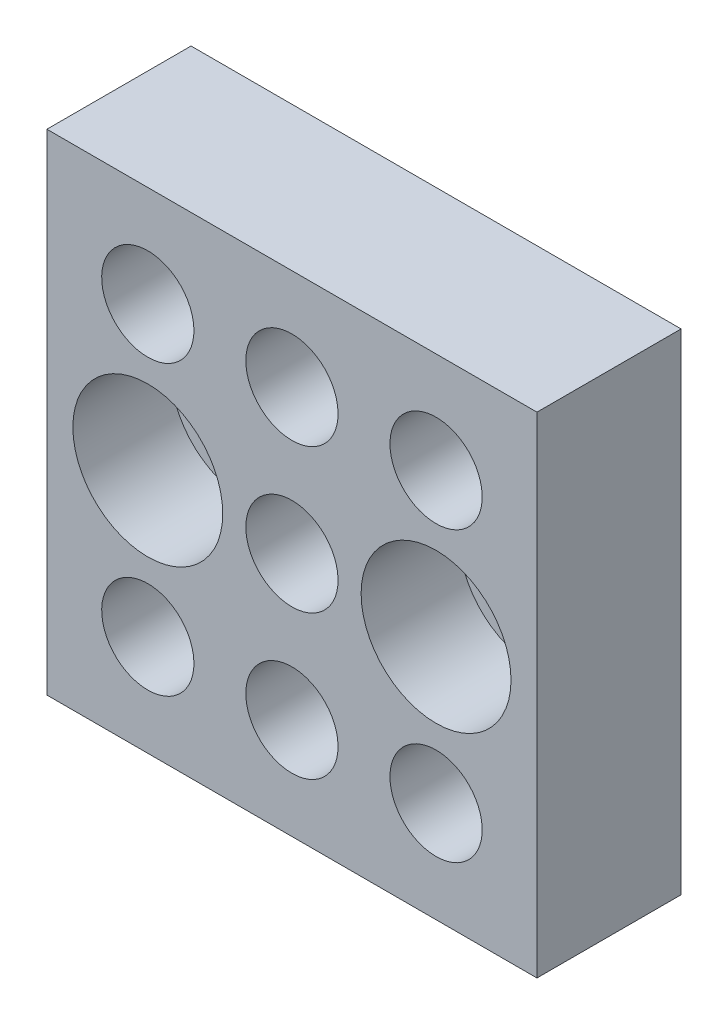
ISO-10303-21;
HEADER;
FILE_DESCRIPTION(('STEP AP214'),'2;1');
FILE_NAME('part.step','',(''),(''),'','','');
FILE_SCHEMA(('AUTOMOTIVE_DESIGN { 1 0 10303 214 1 1 1 1 }'));
ENDSEC;
DATA;
#1=APPLICATION_CONTEXT('core data for automotive mechanical design processes');
#2=APPLICATION_PROTOCOL_DEFINITION('international standard','automotive_design',2000,#1);
#3=PRODUCT_CONTEXT('',#1,'mechanical');
#4=PRODUCT('Part','Part','',(#3));
#5=PRODUCT_RELATED_PRODUCT_CATEGORY('part','',(#4));
#6=PRODUCT_DEFINITION_FORMATION('','',#4);
#7=PRODUCT_DEFINITION_CONTEXT('part definition',#1,'design');
#8=PRODUCT_DEFINITION('design','',#6,#7);
#9=PRODUCT_DEFINITION_SHAPE('','',#8);
#10=(LENGTH_UNIT() NAMED_UNIT(*) SI_UNIT(.MILLI.,.METRE.));
#11=(NAMED_UNIT(*) PLANE_ANGLE_UNIT() SI_UNIT($,.RADIAN.));
#12=(NAMED_UNIT(*) SI_UNIT($,.STERADIAN.) SOLID_ANGLE_UNIT());
#13=UNCERTAINTY_MEASURE_WITH_UNIT(LENGTH_MEASURE(1.E-05),#10,'distance_accuracy_value','');
#14=(GEOMETRIC_REPRESENTATION_CONTEXT(3) GLOBAL_UNCERTAINTY_ASSIGNED_CONTEXT((#13)) GLOBAL_UNIT_ASSIGNED_CONTEXT((#10,
#11,#12)) REPRESENTATION_CONTEXT('',''));
#15=CARTESIAN_POINT('',(0.,0.,0.));
#16=DIRECTION('',(0.,0.,1.));
#17=DIRECTION('',(1.,0.,0.));
#18=AXIS2_PLACEMENT_3D('',#15,#16,#17);
#19=CARTESIAN_POINT('',(-17.5,-42.5,25.));
#20=DIRECTION('',(0.,0.,-1.));
#21=DIRECTION('',(0.,1.,0.));
#22=AXIS2_PLACEMENT_3D('',#19,#20,#21);
#23=PLANE('',#22);
#24=CARTESIAN_POINT('',(50.,0.,25.));
#25=DIRECTION('',(0.,0.,1.));
#26=DIRECTION('',(0.,-1.,0.));
#27=AXIS2_PLACEMENT_3D('',#24,#25,#26);
#28=CIRCLE('',#27,13.);
#29=CARTESIAN_POINT('',(50.,-13.,25.));
#30=VERTEX_POINT('',#29);
#31=EDGE_CURVE('E132',#30,#30,#28,.T.);
#32=ORIENTED_EDGE('',*,*,#31,.F.);
#33=EDGE_LOOP('',(#32));
#34=FACE_BOUND('',#33,.T.);
#35=CARTESIAN_POINT('',(50.,25.,25.));
#36=DIRECTION('',(0.,0.,1.));
#37=DIRECTION('',(0.,-1.,0.));
#38=AXIS2_PLACEMENT_3D('',#35,#36,#37);
#39=CIRCLE('',#38,8.);
#40=CARTESIAN_POINT('',(50.,17.,25.));
#41=VERTEX_POINT('',#40);
#42=EDGE_CURVE('E120',#41,#41,#39,.T.);
#43=ORIENTED_EDGE('',*,*,#42,.F.);
#44=EDGE_LOOP('',(#43));
#45=FACE_BOUND('',#44,.T.);
#46=CARTESIAN_POINT('',(25.,25.,25.));
#47=DIRECTION('',(0.,0.,1.));
#48=DIRECTION('',(0.,-1.,0.));
#49=AXIS2_PLACEMENT_3D('',#46,#47,#48);
#50=CIRCLE('',#49,8.);
#51=CARTESIAN_POINT('',(25.,17.,25.));
#52=VERTEX_POINT('',#51);
#53=EDGE_CURVE('E108',#52,#52,#50,.T.);
#54=ORIENTED_EDGE('',*,*,#53,.F.);
#55=EDGE_LOOP('',(#54));
#56=FACE_BOUND('',#55,.T.);
#57=CARTESIAN_POINT('',(0.,-25.,25.));
#58=DIRECTION('',(0.,0.,1.));
#59=DIRECTION('',(0.,-1.,0.));
#60=AXIS2_PLACEMENT_3D('',#57,#58,#59);
#61=CIRCLE('',#60,8.);
#62=CARTESIAN_POINT('',(0.,-33.,25.));
#63=VERTEX_POINT('',#62);
#64=EDGE_CURVE('E96',#63,#63,#61,.T.);
#65=ORIENTED_EDGE('',*,*,#64,.F.);
#66=EDGE_LOOP('',(#65));
#67=FACE_BOUND('',#66,.T.);
#68=DIRECTION('',(-1.,0.,0.));
#69=VECTOR('',#68,1.);
#70=CARTESIAN_POINT('',(67.5,-42.5,25.));
#71=LINE('',#70,#69);
#72=CARTESIAN_POINT('',(67.5,-42.5,25.));
#73=VERTEX_POINT('',#72);
#74=CARTESIAN_POINT('',(-17.5,-42.5,25.));
#75=VERTEX_POINT('',#74);
#76=EDGE_CURVE('E56',#73,#75,#71,.T.);
#77=ORIENTED_EDGE('',*,*,#76,.F.);
#78=DIRECTION('',(0.,-1.,0.));
#79=VECTOR('',#78,1.);
#80=CARTESIAN_POINT('',(67.5,42.5,25.));
#81=LINE('',#80,#79);
#82=CARTESIAN_POINT('',(67.5,42.5,25.));
#83=VERTEX_POINT('',#82);
#84=EDGE_CURVE('E62',#83,#73,#81,.T.);
#85=ORIENTED_EDGE('',*,*,#84,.F.);
#86=DIRECTION('',(1.,0.,0.));
#87=VECTOR('',#86,1.);
#88=CARTESIAN_POINT('',(-17.5,42.5,25.));
#89=LINE('',#88,#87);
#90=CARTESIAN_POINT('',(-17.5,42.5,25.));
#91=VERTEX_POINT('',#90);
#92=EDGE_CURVE('E81',#91,#83,#89,.T.);
#93=ORIENTED_EDGE('',*,*,#92,.F.);
#94=DIRECTION('',(0.,1.,0.));
#95=VECTOR('',#94,1.);
#96=CARTESIAN_POINT('',(-17.5,-42.5,25.));
#97=LINE('',#96,#95);
#98=EDGE_CURVE('E83',#75,#91,#97,.T.);
#99=ORIENTED_EDGE('',*,*,#98,.F.);
#100=EDGE_LOOP('',(#77,#85,#93,#99));
#101=FACE_BOUND('',#100,.T.);
#102=CARTESIAN_POINT('',(25.,-25.,25.));
#103=DIRECTION('',(0.,0.,1.));
#104=DIRECTION('',(0.,-1.,0.));
#105=AXIS2_PLACEMENT_3D('',#102,#103,#104);
#106=CIRCLE('',#105,8.);
#107=CARTESIAN_POINT('',(25.,-33.,25.));
#108=VERTEX_POINT('',#107);
#109=EDGE_CURVE('E72',#108,#108,#106,.T.);
#110=ORIENTED_EDGE('',*,*,#109,.F.);
#111=EDGE_LOOP('',(#110));
#112=FACE_BOUND('',#111,.T.);
#113=CARTESIAN_POINT('',(0.,25.,25.));
#114=DIRECTION('',(0.,0.,1.));
#115=DIRECTION('',(0.,-1.,0.));
#116=AXIS2_PLACEMENT_3D('',#113,#114,#115);
#117=CIRCLE('',#116,8.);
#118=CARTESIAN_POINT('',(0.,17.,25.));
#119=VERTEX_POINT('',#118);
#120=EDGE_CURVE('E102',#119,#119,#117,.T.);
#121=ORIENTED_EDGE('',*,*,#120,.F.);
#122=EDGE_LOOP('',(#121));
#123=FACE_BOUND('',#122,.T.);
#124=CARTESIAN_POINT('',(25.,0.,25.));
#125=DIRECTION('',(0.,0.,1.));
#126=DIRECTION('',(0.,-1.,0.));
#127=AXIS2_PLACEMENT_3D('',#124,#125,#126);
#128=CIRCLE('',#127,8.);
#129=CARTESIAN_POINT('',(25.,-8.,25.));
#130=VERTEX_POINT('',#129);
#131=EDGE_CURVE('E114',#130,#130,#128,.T.);
#132=ORIENTED_EDGE('',*,*,#131,.F.);
#133=EDGE_LOOP('',(#132));
#134=FACE_BOUND('',#133,.T.);
#135=CARTESIAN_POINT('',(50.,-25.,25.));
#136=DIRECTION('',(0.,0.,1.));
#137=DIRECTION('',(0.,-1.,0.));
#138=AXIS2_PLACEMENT_3D('',#135,#136,#137);
#139=CIRCLE('',#138,8.);
#140=CARTESIAN_POINT('',(50.,-33.,25.));
#141=VERTEX_POINT('',#140);
#142=EDGE_CURVE('E126',#141,#141,#139,.T.);
#143=ORIENTED_EDGE('',*,*,#142,.F.);
#144=EDGE_LOOP('',(#143));
#145=FACE_BOUND('',#144,.T.);
#146=CARTESIAN_POINT('',(0.,0.,25.));
#147=DIRECTION('',(0.,0.,1.));
#148=DIRECTION('',(0.,-1.,0.));
#149=AXIS2_PLACEMENT_3D('',#146,#147,#148);
#150=CIRCLE('',#149,13.);
#151=CARTESIAN_POINT('',(0.,-13.,25.));
#152=VERTEX_POINT('',#151);
#153=EDGE_CURVE('E144',#152,#152,#150,.T.);
#154=ORIENTED_EDGE('',*,*,#153,.F.);
#155=EDGE_LOOP('',(#154));
#156=FACE_BOUND('',#155,.T.);
#157=ADVANCED_FACE('F14',(#34,#45,#56,#67,#101,#112,#123,#134,#145,#156),#23,.F.);
#158=CARTESIAN_POINT('',(-17.5,-42.5,0.));
#159=DIRECTION('',(0.,0.,-1.));
#160=DIRECTION('',(0.,1.,0.));
#161=AXIS2_PLACEMENT_3D('',#158,#159,#160);
#162=PLANE('',#161);
#163=CARTESIAN_POINT('',(50.,0.,0.));
#164=DIRECTION('',(0.,0.,1.));
#165=DIRECTION('',(0.,-1.,0.));
#166=AXIS2_PLACEMENT_3D('',#163,#164,#165);
#167=CIRCLE('',#166,9.);
#168=CARTESIAN_POINT('',(50.,-9.,0.));
#169=VERTEX_POINT('',#168);
#170=EDGE_CURVE('E141',#169,#169,#167,.T.);
#171=ORIENTED_EDGE('',*,*,#170,.T.);
#172=EDGE_LOOP('',(#171));
#173=FACE_BOUND('',#172,.T.);
#174=CARTESIAN_POINT('',(50.,25.,0.));
#175=DIRECTION('',(0.,0.,1.));
#176=DIRECTION('',(0.,-1.,0.));
#177=AXIS2_PLACEMENT_3D('',#174,#175,#176);
#178=CIRCLE('',#177,8.);
#179=CARTESIAN_POINT('',(50.,17.,0.));
#180=VERTEX_POINT('',#179);
#181=EDGE_CURVE('E123',#180,#180,#178,.T.);
#182=ORIENTED_EDGE('',*,*,#181,.T.);
#183=EDGE_LOOP('',(#182));
#184=FACE_BOUND('',#183,.T.);
#185=CARTESIAN_POINT('',(25.,25.,0.));
#186=DIRECTION('',(0.,0.,1.));
#187=DIRECTION('',(0.,-1.,0.));
#188=AXIS2_PLACEMENT_3D('',#185,#186,#187);
#189=CIRCLE('',#188,8.);
#190=CARTESIAN_POINT('',(25.,17.,0.));
#191=VERTEX_POINT('',#190);
#192=EDGE_CURVE('E111',#191,#191,#189,.T.);
#193=ORIENTED_EDGE('',*,*,#192,.T.);
#194=EDGE_LOOP('',(#193));
#195=FACE_BOUND('',#194,.T.);
#196=CARTESIAN_POINT('',(0.,-25.,0.));
#197=DIRECTION('',(0.,0.,1.));
#198=DIRECTION('',(0.,-1.,0.));
#199=AXIS2_PLACEMENT_3D('',#196,#197,#198);
#200=CIRCLE('',#199,8.);
#201=CARTESIAN_POINT('',(0.,-33.,0.));
#202=VERTEX_POINT('',#201);
#203=EDGE_CURVE('E99',#202,#202,#200,.T.);
#204=ORIENTED_EDGE('',*,*,#203,.T.);
#205=EDGE_LOOP('',(#204));
#206=FACE_BOUND('',#205,.T.);
#207=DIRECTION('',(-1.,0.,0.));
#208=VECTOR('',#207,1.);
#209=CARTESIAN_POINT('',(67.5,-42.5,0.));
#210=LINE('',#209,#208);
#211=CARTESIAN_POINT('',(67.5,-42.5,0.));
#212=VERTEX_POINT('',#211);
#213=CARTESIAN_POINT('',(-17.5,-42.5,0.));
#214=VERTEX_POINT('',#213);
#215=EDGE_CURVE('E54',#212,#214,#210,.T.);
#216=ORIENTED_EDGE('',*,*,#215,.T.);
#217=DIRECTION('',(0.,1.,0.));
#218=VECTOR('',#217,1.);
#219=CARTESIAN_POINT('',(-17.5,-42.5,0.));
#220=LINE('',#219,#218);
#221=CARTESIAN_POINT('',(-17.5,42.5,0.));
#222=VERTEX_POINT('',#221);
#223=EDGE_CURVE('E69',#214,#222,#220,.T.);
#224=ORIENTED_EDGE('',*,*,#223,.T.);
#225=DIRECTION('',(1.,0.,0.));
#226=VECTOR('',#225,1.);
#227=CARTESIAN_POINT('',(-17.5,42.5,0.));
#228=LINE('',#227,#226);
#229=CARTESIAN_POINT('',(67.5,42.5,0.));
#230=VERTEX_POINT('',#229);
#231=EDGE_CURVE('E75',#222,#230,#228,.T.);
#232=ORIENTED_EDGE('',*,*,#231,.T.);
#233=DIRECTION('',(0.,-1.,0.));
#234=VECTOR('',#233,1.);
#235=CARTESIAN_POINT('',(67.5,42.5,0.));
#236=LINE('',#235,#234);
#237=EDGE_CURVE('E71',#230,#212,#236,.T.);
#238=ORIENTED_EDGE('',*,*,#237,.T.);
#239=EDGE_LOOP('',(#216,#224,#232,#238));
#240=FACE_BOUND('',#239,.T.);
#241=CARTESIAN_POINT('',(25.,-25.,0.));
#242=DIRECTION('',(0.,0.,1.));
#243=DIRECTION('',(0.,-1.,0.));
#244=AXIS2_PLACEMENT_3D('',#241,#242,#243);
#245=CIRCLE('',#244,8.);
#246=CARTESIAN_POINT('',(25.,-33.,0.));
#247=VERTEX_POINT('',#246);
#248=EDGE_CURVE('E93',#247,#247,#245,.T.);
#249=ORIENTED_EDGE('',*,*,#248,.T.);
#250=EDGE_LOOP('',(#249));
#251=FACE_BOUND('',#250,.T.);
#252=CARTESIAN_POINT('',(0.,25.,0.));
#253=DIRECTION('',(0.,0.,1.));
#254=DIRECTION('',(0.,-1.,0.));
#255=AXIS2_PLACEMENT_3D('',#252,#253,#254);
#256=CIRCLE('',#255,8.);
#257=CARTESIAN_POINT('',(0.,17.,0.));
#258=VERTEX_POINT('',#257);
#259=EDGE_CURVE('E105',#258,#258,#256,.T.);
#260=ORIENTED_EDGE('',*,*,#259,.T.);
#261=EDGE_LOOP('',(#260));
#262=FACE_BOUND('',#261,.T.);
#263=CARTESIAN_POINT('',(25.,0.,0.));
#264=DIRECTION('',(0.,0.,1.));
#265=DIRECTION('',(0.,-1.,0.));
#266=AXIS2_PLACEMENT_3D('',#263,#264,#265);
#267=CIRCLE('',#266,8.);
#268=CARTESIAN_POINT('',(25.,-8.,0.));
#269=VERTEX_POINT('',#268);
#270=EDGE_CURVE('E117',#269,#269,#267,.T.);
#271=ORIENTED_EDGE('',*,*,#270,.T.);
#272=EDGE_LOOP('',(#271));
#273=FACE_BOUND('',#272,.T.);
#274=CARTESIAN_POINT('',(50.,-25.,0.));
#275=DIRECTION('',(0.,0.,1.));
#276=DIRECTION('',(0.,-1.,0.));
#277=AXIS2_PLACEMENT_3D('',#274,#275,#276);
#278=CIRCLE('',#277,8.);
#279=CARTESIAN_POINT('',(50.,-33.,0.));
#280=VERTEX_POINT('',#279);
#281=EDGE_CURVE('E129',#280,#280,#278,.T.);
#282=ORIENTED_EDGE('',*,*,#281,.T.);
#283=EDGE_LOOP('',(#282));
#284=FACE_BOUND('',#283,.T.);
#285=CARTESIAN_POINT('',(0.,0.,0.));
#286=DIRECTION('',(0.,0.,1.));
#287=DIRECTION('',(0.,-1.,0.));
#288=AXIS2_PLACEMENT_3D('',#285,#286,#287);
#289=CIRCLE('',#288,9.);
#290=CARTESIAN_POINT('',(0.,-9.,0.));
#291=VERTEX_POINT('',#290);
#292=EDGE_CURVE('E153',#291,#291,#289,.T.);
#293=ORIENTED_EDGE('',*,*,#292,.T.);
#294=EDGE_LOOP('',(#293));
#295=FACE_BOUND('',#294,.T.);
#296=ADVANCED_FACE('F66',(#173,#184,#195,#206,#240,#251,#262,#273,#284,#295),#162,.T.);
#297=CARTESIAN_POINT('',(67.5,-42.5,25.));
#298=DIRECTION('',(0.,-1.,0.));
#299=DIRECTION('',(1.,0.,0.));
#300=AXIS2_PLACEMENT_3D('',#297,#298,#299);
#301=PLANE('',#300);
#302=DIRECTION('',(0.,0.,-1.));
#303=VECTOR('',#302,1.);
#304=CARTESIAN_POINT('',(67.5,-42.5,25.));
#305=LINE('',#304,#303);
#306=EDGE_CURVE('E9',#73,#212,#305,.T.);
#307=ORIENTED_EDGE('',*,*,#306,.F.);
#308=ORIENTED_EDGE('',*,*,#76,.T.);
#309=DIRECTION('',(0.,0.,-1.));
#310=VECTOR('',#309,1.);
#311=CARTESIAN_POINT('',(-17.5,-42.5,25.));
#312=LINE('',#311,#310);
#313=EDGE_CURVE('E51',#75,#214,#312,.T.);
#314=ORIENTED_EDGE('',*,*,#313,.T.);
#315=ORIENTED_EDGE('',*,*,#215,.F.);
#316=EDGE_LOOP('',(#307,#308,#314,#315));
#317=FACE_BOUND('',#316,.T.);
#318=ADVANCED_FACE('F53',(#317),#301,.T.);
#319=CARTESIAN_POINT('',(67.5,42.5,25.));
#320=DIRECTION('',(1.,0.,0.));
#321=DIRECTION('',(0.,1.,0.));
#322=AXIS2_PLACEMENT_3D('',#319,#320,#321);
#323=PLANE('',#322);
#324=DIRECTION('',(0.,0.,-1.));
#325=VECTOR('',#324,1.);
#326=CARTESIAN_POINT('',(67.5,42.5,25.));
#327=LINE('',#326,#325);
#328=EDGE_CURVE('E22',#83,#230,#327,.T.);
#329=ORIENTED_EDGE('',*,*,#328,.F.);
#330=ORIENTED_EDGE('',*,*,#84,.T.);
#331=ORIENTED_EDGE('',*,*,#306,.T.);
#332=ORIENTED_EDGE('',*,*,#237,.F.);
#333=EDGE_LOOP('',(#329,#330,#331,#332));
#334=FACE_BOUND('',#333,.T.);
#335=ADVANCED_FACE('F16',(#334),#323,.T.);
#336=CARTESIAN_POINT('',(-17.5,42.5,25.));
#337=DIRECTION('',(0.,1.,0.));
#338=DIRECTION('',(-1.,0.,0.));
#339=AXIS2_PLACEMENT_3D('',#336,#337,#338);
#340=PLANE('',#339);
#341=DIRECTION('',(0.,0.,-1.));
#342=VECTOR('',#341,1.);
#343=CARTESIAN_POINT('',(-17.5,42.5,25.));
#344=LINE('',#343,#342);
#345=EDGE_CURVE('E61',#91,#222,#344,.T.);
#346=ORIENTED_EDGE('',*,*,#345,.F.);
#347=ORIENTED_EDGE('',*,*,#92,.T.);
#348=ORIENTED_EDGE('',*,*,#328,.T.);
#349=ORIENTED_EDGE('',*,*,#231,.F.);
#350=EDGE_LOOP('',(#346,#347,#348,#349));
#351=FACE_BOUND('',#350,.T.);
#352=ADVANCED_FACE('F87',(#351),#340,.T.);
#353=CARTESIAN_POINT('',(-17.5,-42.5,25.));
#354=DIRECTION('',(-1.,0.,0.));
#355=DIRECTION('',(0.,-1.,0.));
#356=AXIS2_PLACEMENT_3D('',#353,#354,#355);
#357=PLANE('',#356);
#358=ORIENTED_EDGE('',*,*,#98,.T.);
#359=ORIENTED_EDGE('',*,*,#345,.T.);
#360=ORIENTED_EDGE('',*,*,#223,.F.);
#361=ORIENTED_EDGE('',*,*,#313,.F.);
#362=EDGE_LOOP('',(#358,#359,#360,#361));
#363=FACE_BOUND('',#362,.T.);
#364=ADVANCED_FACE('F74',(#363),#357,.T.);
#365=CARTESIAN_POINT('',(25.,-25.,25.));
#366=DIRECTION('',(0.,0.,-1.));
#367=DIRECTION('',(0.,1.,0.));
#368=AXIS2_PLACEMENT_3D('',#365,#366,#367);
#369=CYLINDRICAL_SURFACE('',#368,8.);
#370=ORIENTED_EDGE('',*,*,#109,.T.);
#371=EDGE_LOOP('',(#370));
#372=FACE_BOUND('',#371,.T.);
#373=ORIENTED_EDGE('',*,*,#248,.F.);
#374=EDGE_LOOP('',(#373));
#375=FACE_BOUND('',#374,.T.);
#376=ADVANCED_FACE('F185',(#372,#375),#369,.F.);
#377=CARTESIAN_POINT('',(0.,-25.,25.));
#378=DIRECTION('',(0.,0.,-1.));
#379=DIRECTION('',(0.,1.,0.));
#380=AXIS2_PLACEMENT_3D('',#377,#378,#379);
#381=CYLINDRICAL_SURFACE('',#380,8.);
#382=ORIENTED_EDGE('',*,*,#64,.T.);
#383=EDGE_LOOP('',(#382));
#384=FACE_BOUND('',#383,.T.);
#385=ORIENTED_EDGE('',*,*,#203,.F.);
#386=EDGE_LOOP('',(#385));
#387=FACE_BOUND('',#386,.T.);
#388=ADVANCED_FACE('F313',(#384,#387),#381,.F.);
#389=CARTESIAN_POINT('',(0.,25.,25.));
#390=DIRECTION('',(0.,0.,-1.));
#391=DIRECTION('',(0.,1.,0.));
#392=AXIS2_PLACEMENT_3D('',#389,#390,#391);
#393=CYLINDRICAL_SURFACE('',#392,8.);
#394=ORIENTED_EDGE('',*,*,#120,.T.);
#395=EDGE_LOOP('',(#394));
#396=FACE_BOUND('',#395,.T.);
#397=ORIENTED_EDGE('',*,*,#259,.F.);
#398=EDGE_LOOP('',(#397));
#399=FACE_BOUND('',#398,.T.);
#400=ADVANCED_FACE('F303',(#396,#399),#393,.F.);
#401=CARTESIAN_POINT('',(25.,25.,25.));
#402=DIRECTION('',(0.,0.,-1.));
#403=DIRECTION('',(0.,1.,0.));
#404=AXIS2_PLACEMENT_3D('',#401,#402,#403);
#405=CYLINDRICAL_SURFACE('',#404,8.);
#406=ORIENTED_EDGE('',*,*,#53,.T.);
#407=EDGE_LOOP('',(#406));
#408=FACE_BOUND('',#407,.T.);
#409=ORIENTED_EDGE('',*,*,#192,.F.);
#410=EDGE_LOOP('',(#409));
#411=FACE_BOUND('',#410,.T.);
#412=ADVANCED_FACE('F293',(#408,#411),#405,.F.);
#413=CARTESIAN_POINT('',(25.,0.,25.));
#414=DIRECTION('',(0.,0.,-1.));
#415=DIRECTION('',(0.,1.,0.));
#416=AXIS2_PLACEMENT_3D('',#413,#414,#415);
#417=CYLINDRICAL_SURFACE('',#416,8.);
#418=ORIENTED_EDGE('',*,*,#131,.T.);
#419=EDGE_LOOP('',(#418));
#420=FACE_BOUND('',#419,.T.);
#421=ORIENTED_EDGE('',*,*,#270,.F.);
#422=EDGE_LOOP('',(#421));
#423=FACE_BOUND('',#422,.T.);
#424=ADVANCED_FACE('F283',(#420,#423),#417,.F.);
#425=CARTESIAN_POINT('',(50.,25.,25.));
#426=DIRECTION('',(0.,0.,-1.));
#427=DIRECTION('',(0.,1.,0.));
#428=AXIS2_PLACEMENT_3D('',#425,#426,#427);
#429=CYLINDRICAL_SURFACE('',#428,8.);
#430=ORIENTED_EDGE('',*,*,#42,.T.);
#431=EDGE_LOOP('',(#430));
#432=FACE_BOUND('',#431,.T.);
#433=ORIENTED_EDGE('',*,*,#181,.F.);
#434=EDGE_LOOP('',(#433));
#435=FACE_BOUND('',#434,.T.);
#436=ADVANCED_FACE('F273',(#432,#435),#429,.F.);
#437=CARTESIAN_POINT('',(50.,-25.,25.));
#438=DIRECTION('',(0.,0.,-1.));
#439=DIRECTION('',(0.,1.,0.));
#440=AXIS2_PLACEMENT_3D('',#437,#438,#439);
#441=CYLINDRICAL_SURFACE('',#440,8.);
#442=ORIENTED_EDGE('',*,*,#142,.T.);
#443=EDGE_LOOP('',(#442));
#444=FACE_BOUND('',#443,.T.);
#445=ORIENTED_EDGE('',*,*,#281,.F.);
#446=EDGE_LOOP('',(#445));
#447=FACE_BOUND('',#446,.T.);
#448=ADVANCED_FACE('F263',(#444,#447),#441,.F.);
#449=CARTESIAN_POINT('',(50.,0.,25.));
#450=DIRECTION('',(0.,0.,1.));
#451=DIRECTION('',(0.,-1.,0.));
#452=AXIS2_PLACEMENT_3D('',#449,#450,#451);
#453=CYLINDRICAL_SURFACE('',#452,13.);
#454=ORIENTED_EDGE('',*,*,#31,.T.);
#455=EDGE_LOOP('',(#454));
#456=FACE_BOUND('',#455,.T.);
#457=CARTESIAN_POINT('',(50.,0.,8.));
#458=DIRECTION('',(0.,0.,1.));
#459=DIRECTION('',(0.,-1.,0.));
#460=AXIS2_PLACEMENT_3D('',#457,#458,#459);
#461=CIRCLE('',#460,13.);
#462=CARTESIAN_POINT('',(50.,-13.,8.));
#463=VERTEX_POINT('',#462);
#464=EDGE_CURVE('E135',#463,#463,#461,.T.);
#465=ORIENTED_EDGE('',*,*,#464,.F.);
#466=EDGE_LOOP('',(#465));
#467=FACE_BOUND('',#466,.T.);
#468=ADVANCED_FACE('F253',(#456,#467),#453,.F.);
#469=CARTESIAN_POINT('',(50.,-9.,8.));
#470=DIRECTION('',(0.,0.,1.));
#471=DIRECTION('',(0.,-1.,0.));
#472=AXIS2_PLACEMENT_3D('',#469,#470,#471);
#473=PLANE('',#472);
#474=ORIENTED_EDGE('',*,*,#464,.T.);
#475=EDGE_LOOP('',(#474));
#476=FACE_BOUND('',#475,.T.);
#477=CARTESIAN_POINT('',(50.,0.,8.));
#478=DIRECTION('',(0.,0.,1.));
#479=DIRECTION('',(0.,-1.,0.));
#480=AXIS2_PLACEMENT_3D('',#477,#478,#479);
#481=CIRCLE('',#480,9.);
#482=CARTESIAN_POINT('',(50.,-9.,8.));
#483=VERTEX_POINT('',#482);
#484=EDGE_CURVE('E138',#483,#483,#481,.T.);
#485=ORIENTED_EDGE('',*,*,#484,.F.);
#486=EDGE_LOOP('',(#485));
#487=FACE_BOUND('',#486,.T.);
#488=ADVANCED_FACE('F243',(#476,#487),#473,.T.);
#489=CARTESIAN_POINT('',(50.,0.,25.));
#490=DIRECTION('',(0.,0.,1.));
#491=DIRECTION('',(0.,-1.,0.));
#492=AXIS2_PLACEMENT_3D('',#489,#490,#491);
#493=CYLINDRICAL_SURFACE('',#492,9.);
#494=ORIENTED_EDGE('',*,*,#484,.T.);
#495=EDGE_LOOP('',(#494));
#496=FACE_BOUND('',#495,.T.);
#497=ORIENTED_EDGE('',*,*,#170,.F.);
#498=EDGE_LOOP('',(#497));
#499=FACE_BOUND('',#498,.T.);
#500=ADVANCED_FACE('F233',(#496,#499),#493,.F.);
#501=CARTESIAN_POINT('',(0.,0.,25.));
#502=DIRECTION('',(0.,0.,1.));
#503=DIRECTION('',(0.,-1.,0.));
#504=AXIS2_PLACEMENT_3D('',#501,#502,#503);
#505=CYLINDRICAL_SURFACE('',#504,13.);
#506=ORIENTED_EDGE('',*,*,#153,.T.);
#507=EDGE_LOOP('',(#506));
#508=FACE_BOUND('',#507,.T.);
#509=CARTESIAN_POINT('',(0.,0.,8.));
#510=DIRECTION('',(0.,0.,1.));
#511=DIRECTION('',(0.,-1.,0.));
#512=AXIS2_PLACEMENT_3D('',#509,#510,#511);
#513=CIRCLE('',#512,13.);
#514=CARTESIAN_POINT('',(0.,-13.,8.));
#515=VERTEX_POINT('',#514);
#516=EDGE_CURVE('E147',#515,#515,#513,.T.);
#517=ORIENTED_EDGE('',*,*,#516,.F.);
#518=EDGE_LOOP('',(#517));
#519=FACE_BOUND('',#518,.T.);
#520=ADVANCED_FACE('F167',(#508,#519),#505,.F.);
#521=CARTESIAN_POINT('',(0.,-9.,8.));
#522=DIRECTION('',(0.,0.,1.));
#523=DIRECTION('',(0.,-1.,0.));
#524=AXIS2_PLACEMENT_3D('',#521,#522,#523);
#525=PLANE('',#524);
#526=ORIENTED_EDGE('',*,*,#516,.T.);
#527=EDGE_LOOP('',(#526));
#528=FACE_BOUND('',#527,.T.);
#529=CARTESIAN_POINT('',(0.,0.,8.));
#530=DIRECTION('',(0.,0.,1.));
#531=DIRECTION('',(0.,-1.,0.));
#532=AXIS2_PLACEMENT_3D('',#529,#530,#531);
#533=CIRCLE('',#532,9.);
#534=CARTESIAN_POINT('',(0.,-9.,8.));
#535=VERTEX_POINT('',#534);
#536=EDGE_CURVE('E150',#535,#535,#533,.T.);
#537=ORIENTED_EDGE('',*,*,#536,.F.);
#538=EDGE_LOOP('',(#537));
#539=FACE_BOUND('',#538,.T.);
#540=ADVANCED_FACE('F160',(#528,#539),#525,.T.);
#541=CARTESIAN_POINT('',(0.,0.,25.));
#542=DIRECTION('',(0.,0.,1.));
#543=DIRECTION('',(0.,-1.,0.));
#544=AXIS2_PLACEMENT_3D('',#541,#542,#543);
#545=CYLINDRICAL_SURFACE('',#544,9.);
#546=ORIENTED_EDGE('',*,*,#536,.T.);
#547=EDGE_LOOP('',(#546));
#548=FACE_BOUND('',#547,.T.);
#549=ORIENTED_EDGE('',*,*,#292,.F.);
#550=EDGE_LOOP('',(#549));
#551=FACE_BOUND('',#550,.T.);
#552=ADVANCED_FACE('F158',(#548,#551),#545,.F.);
#553=CLOSED_SHELL('',(#157,#296,#318,#335,#352,#364,#376,#388,#400,#412,#424,#436,#448,#468,
#488,#500,#520,#540,#552));
#554=MANIFOLD_SOLID_BREP('B1',#553);
#555=ADVANCED_BREP_SHAPE_REPRESENTATION('',(#18,#554),#14);
#556=SHAPE_DEFINITION_REPRESENTATION(#9,#555);
ENDSEC;
END-ISO-10303-21;
